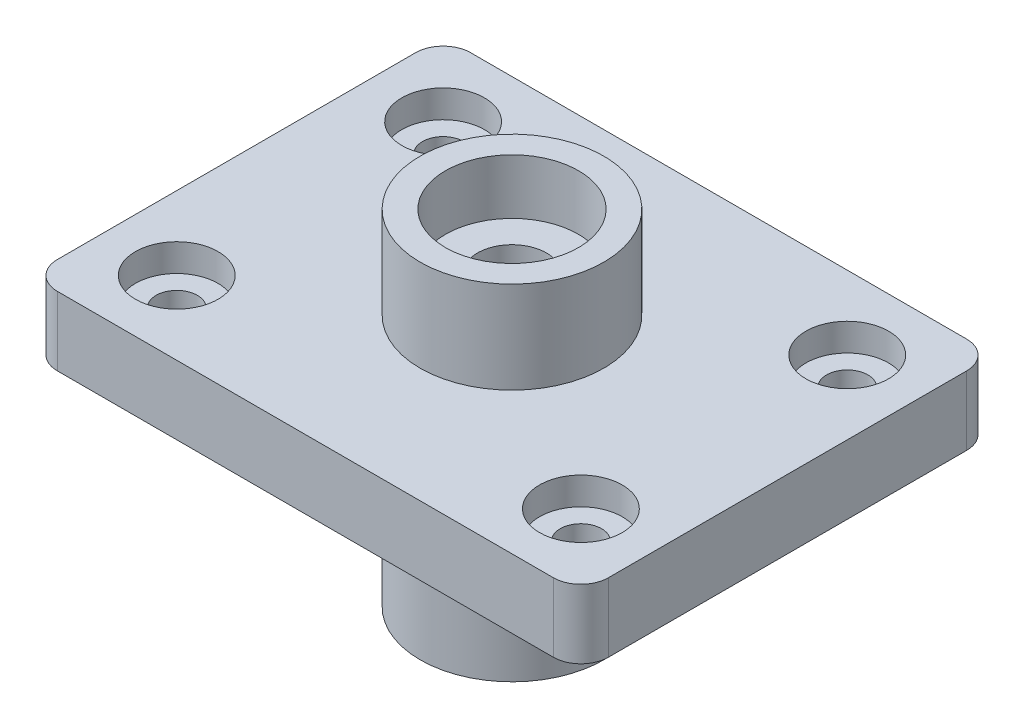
ISO-10303-21;
HEADER;
FILE_DESCRIPTION(('STEP AP214'),'2;1');
FILE_NAME('part.step','',(''),(''),'','','');
FILE_SCHEMA(('AUTOMOTIVE_DESIGN { 1 0 10303 214 1 1 1 1 }'));
ENDSEC;
DATA;
#1=APPLICATION_CONTEXT('core data for automotive mechanical design processes');
#2=APPLICATION_PROTOCOL_DEFINITION('international standard','automotive_design',2000,#1);
#3=PRODUCT_CONTEXT('',#1,'mechanical');
#4=PRODUCT('Part','Part','',(#3));
#5=PRODUCT_RELATED_PRODUCT_CATEGORY('part','',(#4));
#6=PRODUCT_DEFINITION_FORMATION('','',#4);
#7=PRODUCT_DEFINITION_CONTEXT('part definition',#1,'design');
#8=PRODUCT_DEFINITION('design','',#6,#7);
#9=PRODUCT_DEFINITION_SHAPE('','',#8);
#10=(LENGTH_UNIT() NAMED_UNIT(*) SI_UNIT(.MILLI.,.METRE.));
#11=(NAMED_UNIT(*) PLANE_ANGLE_UNIT() SI_UNIT($,.RADIAN.));
#12=(NAMED_UNIT(*) SI_UNIT($,.STERADIAN.) SOLID_ANGLE_UNIT());
#13=UNCERTAINTY_MEASURE_WITH_UNIT(LENGTH_MEASURE(1.E-05),#10,'distance_accuracy_value','');
#14=(GEOMETRIC_REPRESENTATION_CONTEXT(3) GLOBAL_UNCERTAINTY_ASSIGNED_CONTEXT((#13)) GLOBAL_UNIT_ASSIGNED_CONTEXT((#10,
#11,#12)) REPRESENTATION_CONTEXT('',''));
#15=CARTESIAN_POINT('',(0.,0.,0.));
#16=DIRECTION('',(0.,0.,1.));
#17=DIRECTION('',(1.,0.,0.));
#18=AXIS2_PLACEMENT_3D('',#15,#16,#17);
#19=CARTESIAN_POINT('',(0.,40.,0.));
#20=DIRECTION('',(0.,1.,0.));
#21=DIRECTION('',(0.,0.,1.));
#22=AXIS2_PLACEMENT_3D('',#19,#20,#21);
#23=CYLINDRICAL_SURFACE('',#22,15.);
#24=CARTESIAN_POINT('',(0.,-110.,0.));
#25=DIRECTION('',(0.,1.,0.));
#26=DIRECTION('',(0.,0.,1.));
#27=AXIS2_PLACEMENT_3D('',#24,#25,#26);
#28=CIRCLE('',#27,15.);
#29=CARTESIAN_POINT('',(0.,-110.,15.));
#30=VERTEX_POINT('',#29);
#31=EDGE_CURVE('E183',#30,#30,#28,.T.);
#32=ORIENTED_EDGE('',*,*,#31,.F.);
#33=EDGE_LOOP('',(#32));
#34=FACE_BOUND('',#33,.T.);
#35=CARTESIAN_POINT('',(0.,-98.,0.));
#36=DIRECTION('',(0.,1.,0.));
#37=DIRECTION('',(0.,0.,1.));
#38=AXIS2_PLACEMENT_3D('',#35,#36,#37);
#39=CIRCLE('',#38,15.);
#40=CARTESIAN_POINT('',(0.,-98.,15.));
#41=VERTEX_POINT('',#40);
#42=EDGE_CURVE('E177',#41,#41,#39,.F.);
#43=ORIENTED_EDGE('',*,*,#42,.F.);
#44=EDGE_LOOP('',(#43));
#45=FACE_BOUND('',#44,.T.);
#46=ADVANCED_FACE('F30',(#34,#45),#23,.F.);
#47=CARTESIAN_POINT('',(-120.,-30.,-90.));
#48=DIRECTION('',(-1.,0.,0.));
#49=DIRECTION('',(0.,0.,1.));
#50=AXIS2_PLACEMENT_3D('',#47,#48,#49);
#51=PLANE('',#50);
#52=DIRECTION('',(0.,0.,1.));
#53=VECTOR('',#52,1.);
#54=CARTESIAN_POINT('',(-120.,-30.,-90.));
#55=LINE('',#54,#53);
#56=CARTESIAN_POINT('',(-120.,-30.,-78.));
#57=VERTEX_POINT('',#56);
#58=CARTESIAN_POINT('',(-120.,-30.,77.9999999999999));
#59=VERTEX_POINT('',#58);
#60=EDGE_CURVE('E152',#57,#59,#55,.T.);
#61=ORIENTED_EDGE('',*,*,#60,.T.);
#62=DIRECTION('',(0.,1.,0.));
#63=VECTOR('',#62,1.);
#64=CARTESIAN_POINT('',(-120.,-30.,78.));
#65=LINE('',#64,#63);
#66=CARTESIAN_POINT('',(-120.,0.,77.9999999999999));
#67=VERTEX_POINT('',#66);
#68=EDGE_CURVE('E11',#59,#67,#65,.T.);
#69=ORIENTED_EDGE('',*,*,#68,.T.);
#70=DIRECTION('',(0.,0.,1.));
#71=VECTOR('',#70,1.);
#72=CARTESIAN_POINT('',(-120.,0.,-90.));
#73=LINE('',#72,#71);
#74=CARTESIAN_POINT('',(-120.,0.,-78.));
#75=VERTEX_POINT('',#74);
#76=EDGE_CURVE('E155',#75,#67,#73,.T.);
#77=ORIENTED_EDGE('',*,*,#76,.F.);
#78=DIRECTION('',(0.,1.,0.));
#79=VECTOR('',#78,1.);
#80=CARTESIAN_POINT('',(-120.,-30.,-78.));
#81=LINE('',#80,#79);
#82=EDGE_CURVE('E38',#75,#57,#81,.F.);
#83=ORIENTED_EDGE('',*,*,#82,.T.);
#84=EDGE_LOOP('',(#61,#69,#77,#83));
#85=FACE_BOUND('',#84,.T.);
#86=ADVANCED_FACE('F32',(#85),#51,.T.);
#87=CARTESIAN_POINT('',(-120.,-30.,-90.));
#88=DIRECTION('',(0.,0.,-1.));
#89=DIRECTION('',(-1.,0.,0.));
#90=AXIS2_PLACEMENT_3D('',#87,#88,#89);
#91=PLANE('',#90);
#92=DIRECTION('',(-1.,0.,0.));
#93=VECTOR('',#92,1.);
#94=CARTESIAN_POINT('',(-120.,0.,-90.));
#95=LINE('',#94,#93);
#96=CARTESIAN_POINT('',(108.,0.,-90.));
#97=VERTEX_POINT('',#96);
#98=CARTESIAN_POINT('',(-108.,0.,-90.));
#99=VERTEX_POINT('',#98);
#100=EDGE_CURVE('E116',#97,#99,#95,.T.);
#101=ORIENTED_EDGE('',*,*,#100,.F.);
#102=DIRECTION('',(0.,1.,0.));
#103=VECTOR('',#102,1.);
#104=CARTESIAN_POINT('',(108.,-30.,-90.));
#105=LINE('',#104,#103);
#106=CARTESIAN_POINT('',(108.,-30.,-90.));
#107=VERTEX_POINT('',#106);
#108=EDGE_CURVE('E136',#97,#107,#105,.F.);
#109=ORIENTED_EDGE('',*,*,#108,.T.);
#110=DIRECTION('',(-1.,0.,0.));
#111=VECTOR('',#110,1.);
#112=CARTESIAN_POINT('',(-120.,-30.,-90.));
#113=LINE('',#112,#111);
#114=CARTESIAN_POINT('',(-108.,-30.,-90.));
#115=VERTEX_POINT('',#114);
#116=EDGE_CURVE('E124',#107,#115,#113,.T.);
#117=ORIENTED_EDGE('',*,*,#116,.T.);
#118=DIRECTION('',(0.,1.,0.));
#119=VECTOR('',#118,1.);
#120=CARTESIAN_POINT('',(-108.,-30.,-90.));
#121=LINE('',#120,#119);
#122=EDGE_CURVE('E133',#115,#99,#121,.T.);
#123=ORIENTED_EDGE('',*,*,#122,.T.);
#124=EDGE_LOOP('',(#101,#109,#117,#123));
#125=FACE_BOUND('',#124,.T.);
#126=ADVANCED_FACE('F169',(#125),#91,.T.);
#127=CARTESIAN_POINT('',(120.,-30.,-90.));
#128=DIRECTION('',(1.,0.,0.));
#129=DIRECTION('',(0.,0.,-1.));
#130=AXIS2_PLACEMENT_3D('',#127,#128,#129);
#131=PLANE('',#130);
#132=DIRECTION('',(0.,0.,-1.));
#133=VECTOR('',#132,1.);
#134=CARTESIAN_POINT('',(120.,-30.,-90.));
#135=LINE('',#134,#133);
#136=CARTESIAN_POINT('',(120.,-30.,77.9999999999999));
#137=VERTEX_POINT('',#136);
#138=CARTESIAN_POINT('',(120.,-30.,-78.));
#139=VERTEX_POINT('',#138);
#140=EDGE_CURVE('E175',#137,#139,#135,.T.);
#141=ORIENTED_EDGE('',*,*,#140,.T.);
#142=DIRECTION('',(0.,1.,0.));
#143=VECTOR('',#142,1.);
#144=CARTESIAN_POINT('',(120.,-30.,-78.));
#145=LINE('',#144,#143);
#146=CARTESIAN_POINT('',(120.,0.,-78.));
#147=VERTEX_POINT('',#146);
#148=EDGE_CURVE('E115',#139,#147,#145,.T.);
#149=ORIENTED_EDGE('',*,*,#148,.T.);
#150=DIRECTION('',(0.,0.,-1.));
#151=VECTOR('',#150,1.);
#152=CARTESIAN_POINT('',(120.,0.,-90.));
#153=LINE('',#152,#151);
#154=CARTESIAN_POINT('',(120.,0.,77.9999999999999));
#155=VERTEX_POINT('',#154);
#156=EDGE_CURVE('E100',#155,#147,#153,.T.);
#157=ORIENTED_EDGE('',*,*,#156,.F.);
#158=DIRECTION('',(0.,1.,0.));
#159=VECTOR('',#158,1.);
#160=CARTESIAN_POINT('',(120.,-30.,78.));
#161=LINE('',#160,#159);
#162=EDGE_CURVE('E113',#155,#137,#161,.F.);
#163=ORIENTED_EDGE('',*,*,#162,.T.);
#164=EDGE_LOOP('',(#141,#149,#157,#163));
#165=FACE_BOUND('',#164,.T.);
#166=ADVANCED_FACE('F112',(#165),#131,.T.);
#167=CARTESIAN_POINT('',(-120.,-30.,90.));
#168=DIRECTION('',(0.,0.,1.));
#169=DIRECTION('',(1.,0.,0.));
#170=AXIS2_PLACEMENT_3D('',#167,#168,#169);
#171=PLANE('',#170);
#172=DIRECTION('',(1.,0.,0.));
#173=VECTOR('',#172,1.);
#174=CARTESIAN_POINT('',(-120.,-30.,90.));
#175=LINE('',#174,#173);
#176=CARTESIAN_POINT('',(-108.,-30.,90.));
#177=VERTEX_POINT('',#176);
#178=CARTESIAN_POINT('',(108.,-30.,90.));
#179=VERTEX_POINT('',#178);
#180=EDGE_CURVE('E162',#177,#179,#175,.T.);
#181=ORIENTED_EDGE('',*,*,#180,.T.);
#182=DIRECTION('',(0.,1.,0.));
#183=VECTOR('',#182,1.);
#184=CARTESIAN_POINT('',(108.,-30.,90.));
#185=LINE('',#184,#183);
#186=CARTESIAN_POINT('',(108.,0.,90.));
#187=VERTEX_POINT('',#186);
#188=EDGE_CURVE('E146',#179,#187,#185,.T.);
#189=ORIENTED_EDGE('',*,*,#188,.T.);
#190=DIRECTION('',(1.,0.,0.));
#191=VECTOR('',#190,1.);
#192=CARTESIAN_POINT('',(-120.,0.,90.));
#193=LINE('',#192,#191);
#194=CARTESIAN_POINT('',(-108.,0.,90.));
#195=VERTEX_POINT('',#194);
#196=EDGE_CURVE('E101',#195,#187,#193,.T.);
#197=ORIENTED_EDGE('',*,*,#196,.F.);
#198=DIRECTION('',(0.,1.,0.));
#199=VECTOR('',#198,1.);
#200=CARTESIAN_POINT('',(-108.,-30.,90.));
#201=LINE('',#200,#199);
#202=EDGE_CURVE('E52',#195,#177,#201,.F.);
#203=ORIENTED_EDGE('',*,*,#202,.T.);
#204=EDGE_LOOP('',(#181,#189,#197,#203));
#205=FACE_BOUND('',#204,.T.);
#206=ADVANCED_FACE('F215',(#205),#171,.T.);
#207=CARTESIAN_POINT('',(-120.,-30.,90.));
#208=DIRECTION('',(0.,1.,0.));
#209=DIRECTION('',(0.,0.,1.));
#210=AXIS2_PLACEMENT_3D('',#207,#208,#209);
#211=PLANE('',#210);
#212=CARTESIAN_POINT('',(88.,-30.,58.));
#213=DIRECTION('',(0.,1.,0.));
#214=DIRECTION('',(0.,0.,1.));
#215=AXIS2_PLACEMENT_3D('',#212,#213,#214);
#216=CIRCLE('',#215,9.);
#217=CARTESIAN_POINT('',(88.,-30.,67.));
#218=VERTEX_POINT('',#217);
#219=EDGE_CURVE('E545',#218,#218,#216,.T.);
#220=ORIENTED_EDGE('',*,*,#219,.T.);
#221=EDGE_LOOP('',(#220));
#222=FACE_BOUND('',#221,.T.);
#223=CARTESIAN_POINT('',(-88.,-30.,58.));
#224=DIRECTION('',(0.,1.,0.));
#225=DIRECTION('',(0.,0.,1.));
#226=AXIS2_PLACEMENT_3D('',#223,#224,#225);
#227=CIRCLE('',#226,9.);
#228=CARTESIAN_POINT('',(-88.,-30.,67.));
#229=VERTEX_POINT('',#228);
#230=EDGE_CURVE('E557',#229,#229,#227,.T.);
#231=ORIENTED_EDGE('',*,*,#230,.T.);
#232=EDGE_LOOP('',(#231));
#233=FACE_BOUND('',#232,.T.);
#234=CARTESIAN_POINT('',(88.,-30.,-58.));
#235=DIRECTION('',(0.,1.,0.));
#236=DIRECTION('',(0.,0.,1.));
#237=AXIS2_PLACEMENT_3D('',#234,#235,#236);
#238=CIRCLE('',#237,9.);
#239=CARTESIAN_POINT('',(88.,-30.,-49.));
#240=VERTEX_POINT('',#239);
#241=EDGE_CURVE('E569',#240,#240,#238,.T.);
#242=ORIENTED_EDGE('',*,*,#241,.T.);
#243=EDGE_LOOP('',(#242));
#244=FACE_BOUND('',#243,.T.);
#245=CARTESIAN_POINT('',(-88.,-30.,-58.));
#246=DIRECTION('',(0.,1.,0.));
#247=DIRECTION('',(0.,0.,1.));
#248=AXIS2_PLACEMENT_3D('',#245,#246,#247);
#249=CIRCLE('',#248,9.);
#250=CARTESIAN_POINT('',(-88.,-30.,-49.));
#251=VERTEX_POINT('',#250);
#252=EDGE_CURVE('E190',#251,#251,#249,.T.);
#253=ORIENTED_EDGE('',*,*,#252,.T.);
#254=EDGE_LOOP('',(#253));
#255=FACE_BOUND('',#254,.T.);
#256=CARTESIAN_POINT('',(0.,-30.,0.));
#257=DIRECTION('',(0.,1.,0.));
#258=DIRECTION('',(0.,0.,1.));
#259=AXIS2_PLACEMENT_3D('',#256,#257,#258);
#260=CIRCLE('',#259,40.);
#261=CARTESIAN_POINT('',(0.,-30.,40.));
#262=VERTEX_POINT('',#261);
#263=EDGE_CURVE('E211',#262,#262,#260,.T.);
#264=ORIENTED_EDGE('',*,*,#263,.T.);
#265=EDGE_LOOP('',(#264));
#266=FACE_BOUND('',#265,.T.);
#267=ORIENTED_EDGE('',*,*,#116,.F.);
#268=CARTESIAN_POINT('',(108.,-30.,-78.));
#269=DIRECTION('',(0.,1.,0.));
#270=DIRECTION('',(0.,0.,1.));
#271=AXIS2_PLACEMENT_3D('',#268,#269,#270);
#272=CIRCLE('',#271,12.);
#273=EDGE_CURVE('E143',#107,#139,#272,.F.);
#274=ORIENTED_EDGE('',*,*,#273,.T.);
#275=ORIENTED_EDGE('',*,*,#140,.F.);
#276=CARTESIAN_POINT('',(108.,-30.,78.));
#277=DIRECTION('',(0.,1.,0.));
#278=DIRECTION('',(0.,0.,1.));
#279=AXIS2_PLACEMENT_3D('',#276,#277,#278);
#280=CIRCLE('',#279,12.);
#281=EDGE_CURVE('E45',#137,#179,#280,.F.);
#282=ORIENTED_EDGE('',*,*,#281,.T.);
#283=ORIENTED_EDGE('',*,*,#180,.F.);
#284=CARTESIAN_POINT('',(-108.,-30.,78.));
#285=DIRECTION('',(0.,1.,0.));
#286=DIRECTION('',(0.,0.,1.));
#287=AXIS2_PLACEMENT_3D('',#284,#285,#286);
#288=CIRCLE('',#287,12.);
#289=EDGE_CURVE('E140',#177,#59,#288,.F.);
#290=ORIENTED_EDGE('',*,*,#289,.T.);
#291=ORIENTED_EDGE('',*,*,#60,.F.);
#292=CARTESIAN_POINT('',(-108.,-30.,-78.));
#293=DIRECTION('',(0.,1.,0.));
#294=DIRECTION('',(0.,0.,1.));
#295=AXIS2_PLACEMENT_3D('',#292,#293,#294);
#296=CIRCLE('',#295,12.);
#297=EDGE_CURVE('E138',#57,#115,#296,.F.);
#298=ORIENTED_EDGE('',*,*,#297,.T.);
#299=EDGE_LOOP('',(#267,#274,#275,#282,#283,#290,#291,#298));
#300=FACE_BOUND('',#299,.T.);
#301=ADVANCED_FACE('F159',(#222,#233,#244,#255,#266,#300),#211,.F.);
#302=CARTESIAN_POINT('',(-120.,0.,90.));
#303=DIRECTION('',(0.,1.,0.));
#304=DIRECTION('',(0.,0.,1.));
#305=AXIS2_PLACEMENT_3D('',#302,#303,#304);
#306=PLANE('',#305);
#307=CARTESIAN_POINT('',(88.,0.,58.));
#308=DIRECTION('',(0.,1.,0.));
#309=DIRECTION('',(0.,0.,1.));
#310=AXIS2_PLACEMENT_3D('',#307,#308,#309);
#311=CIRCLE('',#310,18.);
#312=CARTESIAN_POINT('',(88.,0.,76.));
#313=VERTEX_POINT('',#312);
#314=EDGE_CURVE('E538',#313,#313,#311,.T.);
#315=ORIENTED_EDGE('',*,*,#314,.F.);
#316=EDGE_LOOP('',(#315));
#317=FACE_BOUND('',#316,.T.);
#318=CARTESIAN_POINT('',(-88.,0.,58.));
#319=DIRECTION('',(0.,1.,0.));
#320=DIRECTION('',(0.,0.,1.));
#321=AXIS2_PLACEMENT_3D('',#318,#319,#320);
#322=CIRCLE('',#321,18.);
#323=CARTESIAN_POINT('',(-88.,0.,76.));
#324=VERTEX_POINT('',#323);
#325=EDGE_CURVE('E548',#324,#324,#322,.T.);
#326=ORIENTED_EDGE('',*,*,#325,.F.);
#327=EDGE_LOOP('',(#326));
#328=FACE_BOUND('',#327,.T.);
#329=CARTESIAN_POINT('',(88.,0.,-58.));
#330=DIRECTION('',(0.,1.,0.));
#331=DIRECTION('',(0.,0.,1.));
#332=AXIS2_PLACEMENT_3D('',#329,#330,#331);
#333=CIRCLE('',#332,18.);
#334=CARTESIAN_POINT('',(88.,0.,-40.));
#335=VERTEX_POINT('',#334);
#336=EDGE_CURVE('E560',#335,#335,#333,.T.);
#337=ORIENTED_EDGE('',*,*,#336,.F.);
#338=EDGE_LOOP('',(#337));
#339=FACE_BOUND('',#338,.T.);
#340=CARTESIAN_POINT('',(-88.,0.,-58.));
#341=DIRECTION('',(0.,1.,0.));
#342=DIRECTION('',(0.,0.,1.));
#343=AXIS2_PLACEMENT_3D('',#340,#341,#342);
#344=CIRCLE('',#343,18.);
#345=CARTESIAN_POINT('',(-88.,0.,-40.));
#346=VERTEX_POINT('',#345);
#347=EDGE_CURVE('E572',#346,#346,#344,.T.);
#348=ORIENTED_EDGE('',*,*,#347,.F.);
#349=EDGE_LOOP('',(#348));
#350=FACE_BOUND('',#349,.T.);
#351=CARTESIAN_POINT('',(0.,0.,0.));
#352=DIRECTION('',(0.,1.,0.));
#353=DIRECTION('',(0.,0.,1.));
#354=AXIS2_PLACEMENT_3D('',#351,#352,#353);
#355=CIRCLE('',#354,40.);
#356=CARTESIAN_POINT('',(0.,0.,40.));
#357=VERTEX_POINT('',#356);
#358=EDGE_CURVE('E119',#357,#357,#355,.T.);
#359=ORIENTED_EDGE('',*,*,#358,.F.);
#360=EDGE_LOOP('',(#359));
#361=FACE_BOUND('',#360,.T.);
#362=ORIENTED_EDGE('',*,*,#156,.T.);
#363=CARTESIAN_POINT('',(108.,0.,-78.));
#364=DIRECTION('',(0.,1.,0.));
#365=DIRECTION('',(0.,0.,1.));
#366=AXIS2_PLACEMENT_3D('',#363,#364,#365);
#367=CIRCLE('',#366,12.);
#368=EDGE_CURVE('E106',#147,#97,#367,.T.);
#369=ORIENTED_EDGE('',*,*,#368,.T.);
#370=ORIENTED_EDGE('',*,*,#100,.T.);
#371=CARTESIAN_POINT('',(-108.,0.,-78.));
#372=DIRECTION('',(0.,1.,0.));
#373=DIRECTION('',(0.,0.,1.));
#374=AXIS2_PLACEMENT_3D('',#371,#372,#373);
#375=CIRCLE('',#374,12.);
#376=EDGE_CURVE('E121',#99,#75,#375,.T.);
#377=ORIENTED_EDGE('',*,*,#376,.T.);
#378=ORIENTED_EDGE('',*,*,#76,.T.);
#379=CARTESIAN_POINT('',(-108.,0.,78.));
#380=DIRECTION('',(0.,1.,0.));
#381=DIRECTION('',(0.,0.,1.));
#382=AXIS2_PLACEMENT_3D('',#379,#380,#381);
#383=CIRCLE('',#382,12.);
#384=EDGE_CURVE('E107',#67,#195,#383,.T.);
#385=ORIENTED_EDGE('',*,*,#384,.T.);
#386=ORIENTED_EDGE('',*,*,#196,.T.);
#387=CARTESIAN_POINT('',(108.,0.,78.));
#388=DIRECTION('',(0.,1.,0.));
#389=DIRECTION('',(0.,0.,1.));
#390=AXIS2_PLACEMENT_3D('',#387,#388,#389);
#391=CIRCLE('',#390,12.);
#392=EDGE_CURVE('E97',#187,#155,#391,.T.);
#393=ORIENTED_EDGE('',*,*,#392,.T.);
#394=EDGE_LOOP('',(#362,#369,#370,#377,#378,#385,#386,#393));
#395=FACE_BOUND('',#394,.T.);
#396=ADVANCED_FACE('F99',(#317,#328,#339,#350,#361,#395),#306,.T.);
#397=CARTESIAN_POINT('',(0.,40.,0.));
#398=DIRECTION('',(0.,1.,0.));
#399=DIRECTION('',(0.,0.,1.));
#400=AXIS2_PLACEMENT_3D('',#397,#398,#399);
#401=PLANE('',#400);
#402=CARTESIAN_POINT('',(0.,40.,0.));
#403=DIRECTION('',(0.,1.,0.));
#404=DIRECTION('',(0.,0.,1.));
#405=AXIS2_PLACEMENT_3D('',#402,#403,#404);
#406=CIRCLE('',#405,29.);
#407=CARTESIAN_POINT('',(0.,40.,29.));
#408=VERTEX_POINT('',#407);
#409=EDGE_CURVE('E202',#408,#408,#406,.T.);
#410=ORIENTED_EDGE('',*,*,#409,.F.);
#411=EDGE_LOOP('',(#410));
#412=FACE_BOUND('',#411,.T.);
#413=CARTESIAN_POINT('',(0.,40.,0.));
#414=DIRECTION('',(0.,1.,0.));
#415=DIRECTION('',(0.,0.,1.));
#416=AXIS2_PLACEMENT_3D('',#413,#414,#415);
#417=CIRCLE('',#416,40.);
#418=CARTESIAN_POINT('',(0.,40.,40.));
#419=VERTEX_POINT('',#418);
#420=EDGE_CURVE('E205',#419,#419,#417,.T.);
#421=ORIENTED_EDGE('',*,*,#420,.T.);
#422=EDGE_LOOP('',(#421));
#423=FACE_BOUND('',#422,.T.);
#424=ADVANCED_FACE('F262',(#412,#423),#401,.T.);
#425=CARTESIAN_POINT('',(0.,-110.,0.));
#426=DIRECTION('',(0.,1.,0.));
#427=DIRECTION('',(0.,0.,1.));
#428=AXIS2_PLACEMENT_3D('',#425,#426,#427);
#429=CYLINDRICAL_SURFACE('',#428,40.);
#430=ORIENTED_EDGE('',*,*,#358,.T.);
#431=EDGE_LOOP('',(#430));
#432=FACE_BOUND('',#431,.T.);
#433=ORIENTED_EDGE('',*,*,#420,.F.);
#434=EDGE_LOOP('',(#433));
#435=FACE_BOUND('',#434,.T.);
#436=ADVANCED_FACE('F265',(#432,#435),#429,.T.);
#437=CARTESIAN_POINT('',(0.,-110.,0.));
#438=DIRECTION('',(0.,1.,0.));
#439=DIRECTION('',(0.,0.,1.));
#440=AXIS2_PLACEMENT_3D('',#437,#438,#439);
#441=CIRCLE('',#440,40.);
#442=CARTESIAN_POINT('',(0.,-110.,40.));
#443=VERTEX_POINT('',#442);
#444=EDGE_CURVE('E208',#443,#443,#441,.T.);
#445=ORIENTED_EDGE('',*,*,#444,.T.);
#446=EDGE_LOOP('',(#445));
#447=FACE_BOUND('',#446,.T.);
#448=ORIENTED_EDGE('',*,*,#263,.F.);
#449=EDGE_LOOP('',(#448));
#450=FACE_BOUND('',#449,.T.);
#451=ADVANCED_FACE('F270',(#447,#450),#429,.T.);
#452=CARTESIAN_POINT('',(0.,-110.,0.));
#453=DIRECTION('',(0.,1.,0.));
#454=DIRECTION('',(0.,0.,1.));
#455=AXIS2_PLACEMENT_3D('',#452,#453,#454);
#456=PLANE('',#455);
#457=ORIENTED_EDGE('',*,*,#31,.T.);
#458=EDGE_LOOP('',(#457));
#459=FACE_BOUND('',#458,.T.);
#460=ORIENTED_EDGE('',*,*,#444,.F.);
#461=EDGE_LOOP('',(#460));
#462=FACE_BOUND('',#461,.T.);
#463=ADVANCED_FACE('F258',(#459,#462),#456,.F.);
#464=CARTESIAN_POINT('',(0.,40.,0.));
#465=DIRECTION('',(0.,1.,0.));
#466=DIRECTION('',(0.,0.,1.));
#467=AXIS2_PLACEMENT_3D('',#464,#465,#466);
#468=CYLINDRICAL_SURFACE('',#467,29.);
#469=CARTESIAN_POINT('',(0.,16.,0.));
#470=DIRECTION('',(0.,1.,0.));
#471=DIRECTION('',(0.,0.,1.));
#472=AXIS2_PLACEMENT_3D('',#469,#470,#471);
#473=CIRCLE('',#472,29.);
#474=CARTESIAN_POINT('',(0.,16.,29.));
#475=VERTEX_POINT('',#474);
#476=EDGE_CURVE('E199',#475,#475,#473,.T.);
#477=ORIENTED_EDGE('',*,*,#476,.F.);
#478=EDGE_LOOP('',(#477));
#479=FACE_BOUND('',#478,.T.);
#480=ORIENTED_EDGE('',*,*,#409,.T.);
#481=EDGE_LOOP('',(#480));
#482=FACE_BOUND('',#481,.T.);
#483=ADVANCED_FACE('F248',(#479,#482),#468,.F.);
#484=CARTESIAN_POINT('',(15.,16.,0.));
#485=DIRECTION('',(0.,-1.,0.));
#486=DIRECTION('',(0.,0.,-1.));
#487=AXIS2_PLACEMENT_3D('',#484,#485,#486);
#488=PLANE('',#487);
#489=CARTESIAN_POINT('',(0.,16.,0.));
#490=DIRECTION('',(0.,1.,0.));
#491=DIRECTION('',(0.,0.,1.));
#492=AXIS2_PLACEMENT_3D('',#489,#490,#491);
#493=CIRCLE('',#492,15.);
#494=CARTESIAN_POINT('',(0.,16.,15.));
#495=VERTEX_POINT('',#494);
#496=EDGE_CURVE('E196',#495,#495,#493,.T.);
#497=ORIENTED_EDGE('',*,*,#496,.F.);
#498=EDGE_LOOP('',(#497));
#499=FACE_BOUND('',#498,.T.);
#500=ORIENTED_EDGE('',*,*,#476,.T.);
#501=EDGE_LOOP('',(#500));
#502=FACE_BOUND('',#501,.T.);
#503=ADVANCED_FACE('F239',(#499,#502),#488,.F.);
#504=CARTESIAN_POINT('',(0.,-86.,0.));
#505=DIRECTION('',(0.,1.,0.));
#506=DIRECTION('',(0.,0.,1.));
#507=AXIS2_PLACEMENT_3D('',#504,#505,#506);
#508=CIRCLE('',#507,15.);
#509=CARTESIAN_POINT('',(0.,-86.,15.));
#510=VERTEX_POINT('',#509);
#511=EDGE_CURVE('E127',#510,#510,#508,.F.);
#512=ORIENTED_EDGE('',*,*,#511,.T.);
#513=EDGE_LOOP('',(#512));
#514=FACE_BOUND('',#513,.T.);
#515=ORIENTED_EDGE('',*,*,#496,.T.);
#516=EDGE_LOOP('',(#515));
#517=FACE_BOUND('',#516,.T.);
#518=ADVANCED_FACE('F229',(#514,#517),#23,.F.);
#519=CARTESIAN_POINT('',(0.,-86.,0.));
#520=DIRECTION('',(0.,1.,0.));
#521=DIRECTION('',(0.,0.,1.));
#522=AXIS2_PLACEMENT_3D('',#519,#520,#521);
#523=PLANE('',#522);
#524=CARTESIAN_POINT('',(0.,-86.,0.));
#525=DIRECTION('',(0.,1.,0.));
#526=DIRECTION('',(0.,0.,1.));
#527=AXIS2_PLACEMENT_3D('',#524,#525,#526);
#528=CIRCLE('',#527,23.);
#529=CARTESIAN_POINT('',(0.,-86.,23.));
#530=VERTEX_POINT('',#529);
#531=EDGE_CURVE('E179',#530,#530,#528,.T.);
#532=ORIENTED_EDGE('',*,*,#531,.F.);
#533=EDGE_LOOP('',(#532));
#534=FACE_BOUND('',#533,.T.);
#535=ORIENTED_EDGE('',*,*,#511,.F.);
#536=EDGE_LOOP('',(#535));
#537=FACE_BOUND('',#536,.T.);
#538=ADVANCED_FACE('F238',(#534,#537),#523,.F.);
#539=CARTESIAN_POINT('',(0.,-98.,0.));
#540=DIRECTION('',(0.,1.,0.));
#541=DIRECTION('',(0.,0.,1.));
#542=AXIS2_PLACEMENT_3D('',#539,#540,#541);
#543=PLANE('',#542);
#544=CARTESIAN_POINT('',(0.,-98.,0.));
#545=DIRECTION('',(0.,1.,0.));
#546=DIRECTION('',(0.,0.,1.));
#547=AXIS2_PLACEMENT_3D('',#544,#545,#546);
#548=CIRCLE('',#547,23.);
#549=CARTESIAN_POINT('',(0.,-98.,23.));
#550=VERTEX_POINT('',#549);
#551=EDGE_CURVE('E185',#550,#550,#548,.T.);
#552=ORIENTED_EDGE('',*,*,#551,.T.);
#553=EDGE_LOOP('',(#552));
#554=FACE_BOUND('',#553,.T.);
#555=ORIENTED_EDGE('',*,*,#42,.T.);
#556=EDGE_LOOP('',(#555));
#557=FACE_BOUND('',#556,.T.);
#558=ADVANCED_FACE('F245',(#554,#557),#543,.T.);
#559=CARTESIAN_POINT('',(0.,-86.,0.));
#560=DIRECTION('',(0.,-1.,0.));
#561=DIRECTION('',(0.,0.,-1.));
#562=AXIS2_PLACEMENT_3D('',#559,#560,#561);
#563=CYLINDRICAL_SURFACE('',#562,23.);
#564=ORIENTED_EDGE('',*,*,#531,.T.);
#565=EDGE_LOOP('',(#564));
#566=FACE_BOUND('',#565,.T.);
#567=ORIENTED_EDGE('',*,*,#551,.F.);
#568=EDGE_LOOP('',(#567));
#569=FACE_BOUND('',#568,.T.);
#570=ADVANCED_FACE('F353',(#566,#569),#563,.F.);
#571=CARTESIAN_POINT('',(-88.,0.,-58.));
#572=DIRECTION('',(0.,1.,0.));
#573=DIRECTION('',(0.,0.,1.));
#574=AXIS2_PLACEMENT_3D('',#571,#572,#573);
#575=CYLINDRICAL_SURFACE('',#574,9.);
#576=ORIENTED_EDGE('',*,*,#252,.F.);
#577=EDGE_LOOP('',(#576));
#578=FACE_BOUND('',#577,.T.);
#579=CARTESIAN_POINT('',(-88.,-12.,-58.));
#580=DIRECTION('',(0.,1.,0.));
#581=DIRECTION('',(0.,0.,1.));
#582=AXIS2_PLACEMENT_3D('',#579,#580,#581);
#583=CIRCLE('',#582,9.00000000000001);
#584=CARTESIAN_POINT('',(-88.,-12.,-49.));
#585=VERTEX_POINT('',#584);
#586=EDGE_CURVE('E578',#585,#585,#583,.T.);
#587=ORIENTED_EDGE('',*,*,#586,.T.);
#588=EDGE_LOOP('',(#587));
#589=FACE_BOUND('',#588,.T.);
#590=ADVANCED_FACE('F363',(#578,#589),#575,.F.);
#591=CARTESIAN_POINT('',(-79.,-12.,-58.));
#592=DIRECTION('',(0.,-1.,0.));
#593=DIRECTION('',(0.,0.,-1.));
#594=AXIS2_PLACEMENT_3D('',#591,#592,#593);
#595=PLANE('',#594);
#596=ORIENTED_EDGE('',*,*,#586,.F.);
#597=EDGE_LOOP('',(#596));
#598=FACE_BOUND('',#597,.T.);
#599=CARTESIAN_POINT('',(-88.,-12.,-58.));
#600=DIRECTION('',(0.,1.,0.));
#601=DIRECTION('',(0.,0.,1.));
#602=AXIS2_PLACEMENT_3D('',#599,#600,#601);
#603=CIRCLE('',#602,18.);
#604=CARTESIAN_POINT('',(-88.,-12.,-40.));
#605=VERTEX_POINT('',#604);
#606=EDGE_CURVE('E575',#605,#605,#603,.T.);
#607=ORIENTED_EDGE('',*,*,#606,.T.);
#608=EDGE_LOOP('',(#607));
#609=FACE_BOUND('',#608,.T.);
#610=ADVANCED_FACE('F371',(#598,#609),#595,.F.);
#611=CARTESIAN_POINT('',(-88.,0.,-58.));
#612=DIRECTION('',(0.,1.,0.));
#613=DIRECTION('',(0.,0.,1.));
#614=AXIS2_PLACEMENT_3D('',#611,#612,#613);
#615=CYLINDRICAL_SURFACE('',#614,18.);
#616=ORIENTED_EDGE('',*,*,#606,.F.);
#617=EDGE_LOOP('',(#616));
#618=FACE_BOUND('',#617,.T.);
#619=ORIENTED_EDGE('',*,*,#347,.T.);
#620=EDGE_LOOP('',(#619));
#621=FACE_BOUND('',#620,.T.);
#622=ADVANCED_FACE('F381',(#618,#621),#615,.F.);
#623=CARTESIAN_POINT('',(88.,0.,-58.));
#624=DIRECTION('',(0.,1.,0.));
#625=DIRECTION('',(0.,0.,1.));
#626=AXIS2_PLACEMENT_3D('',#623,#624,#625);
#627=CYLINDRICAL_SURFACE('',#626,9.);
#628=ORIENTED_EDGE('',*,*,#241,.F.);
#629=EDGE_LOOP('',(#628));
#630=FACE_BOUND('',#629,.T.);
#631=CARTESIAN_POINT('',(88.,-12.,-58.));
#632=DIRECTION('',(0.,1.,0.));
#633=DIRECTION('',(0.,0.,1.));
#634=AXIS2_PLACEMENT_3D('',#631,#632,#633);
#635=CIRCLE('',#634,9.00000000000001);
#636=CARTESIAN_POINT('',(88.,-12.,-49.));
#637=VERTEX_POINT('',#636);
#638=EDGE_CURVE('E566',#637,#637,#635,.T.);
#639=ORIENTED_EDGE('',*,*,#638,.T.);
#640=EDGE_LOOP('',(#639));
#641=FACE_BOUND('',#640,.T.);
#642=ADVANCED_FACE('F391',(#630,#641),#627,.F.);
#643=CARTESIAN_POINT('',(97.,-12.,-58.));
#644=DIRECTION('',(0.,-1.,0.));
#645=DIRECTION('',(0.,0.,-1.));
#646=AXIS2_PLACEMENT_3D('',#643,#644,#645);
#647=PLANE('',#646);
#648=ORIENTED_EDGE('',*,*,#638,.F.);
#649=EDGE_LOOP('',(#648));
#650=FACE_BOUND('',#649,.T.);
#651=CARTESIAN_POINT('',(88.,-12.,-58.));
#652=DIRECTION('',(0.,1.,0.));
#653=DIRECTION('',(0.,0.,1.));
#654=AXIS2_PLACEMENT_3D('',#651,#652,#653);
#655=CIRCLE('',#654,18.);
#656=CARTESIAN_POINT('',(88.,-12.,-40.));
#657=VERTEX_POINT('',#656);
#658=EDGE_CURVE('E563',#657,#657,#655,.T.);
#659=ORIENTED_EDGE('',*,*,#658,.T.);
#660=EDGE_LOOP('',(#659));
#661=FACE_BOUND('',#660,.T.);
#662=ADVANCED_FACE('F401',(#650,#661),#647,.F.);
#663=CARTESIAN_POINT('',(88.,0.,-58.));
#664=DIRECTION('',(0.,1.,0.));
#665=DIRECTION('',(0.,0.,1.));
#666=AXIS2_PLACEMENT_3D('',#663,#664,#665);
#667=CYLINDRICAL_SURFACE('',#666,18.);
#668=ORIENTED_EDGE('',*,*,#658,.F.);
#669=EDGE_LOOP('',(#668));
#670=FACE_BOUND('',#669,.T.);
#671=ORIENTED_EDGE('',*,*,#336,.T.);
#672=EDGE_LOOP('',(#671));
#673=FACE_BOUND('',#672,.T.);
#674=ADVANCED_FACE('F411',(#670,#673),#667,.F.);
#675=CARTESIAN_POINT('',(-88.,0.,58.));
#676=DIRECTION('',(0.,1.,0.));
#677=DIRECTION('',(0.,0.,1.));
#678=AXIS2_PLACEMENT_3D('',#675,#676,#677);
#679=CYLINDRICAL_SURFACE('',#678,9.);
#680=ORIENTED_EDGE('',*,*,#230,.F.);
#681=EDGE_LOOP('',(#680));
#682=FACE_BOUND('',#681,.T.);
#683=CARTESIAN_POINT('',(-88.,-12.,58.));
#684=DIRECTION('',(0.,1.,0.));
#685=DIRECTION('',(0.,0.,1.));
#686=AXIS2_PLACEMENT_3D('',#683,#684,#685);
#687=CIRCLE('',#686,9.00000000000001);
#688=CARTESIAN_POINT('',(-88.,-12.,67.));
#689=VERTEX_POINT('',#688);
#690=EDGE_CURVE('E554',#689,#689,#687,.T.);
#691=ORIENTED_EDGE('',*,*,#690,.T.);
#692=EDGE_LOOP('',(#691));
#693=FACE_BOUND('',#692,.T.);
#694=ADVANCED_FACE('F421',(#682,#693),#679,.F.);
#695=CARTESIAN_POINT('',(-79.,-12.,58.));
#696=DIRECTION('',(0.,-1.,0.));
#697=DIRECTION('',(0.,0.,-1.));
#698=AXIS2_PLACEMENT_3D('',#695,#696,#697);
#699=PLANE('',#698);
#700=ORIENTED_EDGE('',*,*,#690,.F.);
#701=EDGE_LOOP('',(#700));
#702=FACE_BOUND('',#701,.T.);
#703=CARTESIAN_POINT('',(-88.,-12.,58.));
#704=DIRECTION('',(0.,1.,0.));
#705=DIRECTION('',(0.,0.,1.));
#706=AXIS2_PLACEMENT_3D('',#703,#704,#705);
#707=CIRCLE('',#706,18.);
#708=CARTESIAN_POINT('',(-88.,-12.,76.));
#709=VERTEX_POINT('',#708);
#710=EDGE_CURVE('E551',#709,#709,#707,.T.);
#711=ORIENTED_EDGE('',*,*,#710,.T.);
#712=EDGE_LOOP('',(#711));
#713=FACE_BOUND('',#712,.T.);
#714=ADVANCED_FACE('F431',(#702,#713),#699,.F.);
#715=CARTESIAN_POINT('',(-88.,0.,58.));
#716=DIRECTION('',(0.,1.,0.));
#717=DIRECTION('',(0.,0.,1.));
#718=AXIS2_PLACEMENT_3D('',#715,#716,#717);
#719=CYLINDRICAL_SURFACE('',#718,18.);
#720=ORIENTED_EDGE('',*,*,#710,.F.);
#721=EDGE_LOOP('',(#720));
#722=FACE_BOUND('',#721,.T.);
#723=ORIENTED_EDGE('',*,*,#325,.T.);
#724=EDGE_LOOP('',(#723));
#725=FACE_BOUND('',#724,.T.);
#726=ADVANCED_FACE('F441',(#722,#725),#719,.F.);
#727=CARTESIAN_POINT('',(88.,0.,58.));
#728=DIRECTION('',(0.,1.,0.));
#729=DIRECTION('',(0.,0.,1.));
#730=AXIS2_PLACEMENT_3D('',#727,#728,#729);
#731=CYLINDRICAL_SURFACE('',#730,9.);
#732=ORIENTED_EDGE('',*,*,#219,.F.);
#733=EDGE_LOOP('',(#732));
#734=FACE_BOUND('',#733,.T.);
#735=CARTESIAN_POINT('',(88.,-12.,58.));
#736=DIRECTION('',(0.,1.,0.));
#737=DIRECTION('',(0.,0.,1.));
#738=AXIS2_PLACEMENT_3D('',#735,#736,#737);
#739=CIRCLE('',#738,9.00000000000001);
#740=CARTESIAN_POINT('',(88.,-12.,67.));
#741=VERTEX_POINT('',#740);
#742=EDGE_CURVE('E540',#741,#741,#739,.T.);
#743=ORIENTED_EDGE('',*,*,#742,.T.);
#744=EDGE_LOOP('',(#743));
#745=FACE_BOUND('',#744,.T.);
#746=ADVANCED_FACE('F451',(#734,#745),#731,.F.);
#747=CARTESIAN_POINT('',(97.,-12.,58.));
#748=DIRECTION('',(0.,-1.,0.));
#749=DIRECTION('',(0.,0.,-1.));
#750=AXIS2_PLACEMENT_3D('',#747,#748,#749);
#751=PLANE('',#750);
#752=ORIENTED_EDGE('',*,*,#742,.F.);
#753=EDGE_LOOP('',(#752));
#754=FACE_BOUND('',#753,.T.);
#755=CARTESIAN_POINT('',(88.,-12.,58.));
#756=DIRECTION('',(0.,1.,0.));
#757=DIRECTION('',(0.,0.,1.));
#758=AXIS2_PLACEMENT_3D('',#755,#756,#757);
#759=CIRCLE('',#758,18.);
#760=CARTESIAN_POINT('',(88.,-12.,76.));
#761=VERTEX_POINT('',#760);
#762=EDGE_CURVE('E535',#761,#761,#759,.T.);
#763=ORIENTED_EDGE('',*,*,#762,.T.);
#764=EDGE_LOOP('',(#763));
#765=FACE_BOUND('',#764,.T.);
#766=ADVANCED_FACE('F461',(#754,#765),#751,.F.);
#767=CARTESIAN_POINT('',(88.,0.,58.));
#768=DIRECTION('',(0.,1.,0.));
#769=DIRECTION('',(0.,0.,1.));
#770=AXIS2_PLACEMENT_3D('',#767,#768,#769);
#771=CYLINDRICAL_SURFACE('',#770,18.);
#772=ORIENTED_EDGE('',*,*,#762,.F.);
#773=EDGE_LOOP('',(#772));
#774=FACE_BOUND('',#773,.T.);
#775=ORIENTED_EDGE('',*,*,#314,.T.);
#776=EDGE_LOOP('',(#775));
#777=FACE_BOUND('',#776,.T.);
#778=ADVANCED_FACE('F471',(#774,#777),#771,.F.);
#779=CARTESIAN_POINT('',(108.,-30.,-78.));
#780=DIRECTION('',(0.,1.,0.));
#781=DIRECTION('',(0.,0.,1.));
#782=AXIS2_PLACEMENT_3D('',#779,#780,#781);
#783=CYLINDRICAL_SURFACE('',#782,12.);
#784=ORIENTED_EDGE('',*,*,#273,.F.);
#785=ORIENTED_EDGE('',*,*,#108,.F.);
#786=ORIENTED_EDGE('',*,*,#368,.F.);
#787=ORIENTED_EDGE('',*,*,#148,.F.);
#788=EDGE_LOOP('',(#784,#785,#786,#787));
#789=FACE_BOUND('',#788,.T.);
#790=ADVANCED_FACE('F224',(#789),#783,.T.);
#791=CARTESIAN_POINT('',(108.,-30.,78.));
#792=DIRECTION('',(0.,1.,0.));
#793=DIRECTION('',(0.,0.,1.));
#794=AXIS2_PLACEMENT_3D('',#791,#792,#793);
#795=CYLINDRICAL_SURFACE('',#794,12.);
#796=ORIENTED_EDGE('',*,*,#281,.F.);
#797=ORIENTED_EDGE('',*,*,#162,.F.);
#798=ORIENTED_EDGE('',*,*,#392,.F.);
#799=ORIENTED_EDGE('',*,*,#188,.F.);
#800=EDGE_LOOP('',(#796,#797,#798,#799));
#801=FACE_BOUND('',#800,.T.);
#802=ADVANCED_FACE('F118',(#801),#795,.T.);
#803=CARTESIAN_POINT('',(-108.,-30.,78.));
#804=DIRECTION('',(0.,1.,0.));
#805=DIRECTION('',(0.,0.,1.));
#806=AXIS2_PLACEMENT_3D('',#803,#804,#805);
#807=CYLINDRICAL_SURFACE('',#806,12.);
#808=ORIENTED_EDGE('',*,*,#289,.F.);
#809=ORIENTED_EDGE('',*,*,#202,.F.);
#810=ORIENTED_EDGE('',*,*,#384,.F.);
#811=ORIENTED_EDGE('',*,*,#68,.F.);
#812=EDGE_LOOP('',(#808,#809,#810,#811));
#813=FACE_BOUND('',#812,.T.);
#814=ADVANCED_FACE('F216',(#813),#807,.T.);
#815=CARTESIAN_POINT('',(-108.,-30.,-78.));
#816=DIRECTION('',(0.,1.,0.));
#817=DIRECTION('',(0.,0.,1.));
#818=AXIS2_PLACEMENT_3D('',#815,#816,#817);
#819=CYLINDRICAL_SURFACE('',#818,12.);
#820=ORIENTED_EDGE('',*,*,#297,.F.);
#821=ORIENTED_EDGE('',*,*,#82,.F.);
#822=ORIENTED_EDGE('',*,*,#376,.F.);
#823=ORIENTED_EDGE('',*,*,#122,.F.);
#824=EDGE_LOOP('',(#820,#821,#822,#823));
#825=FACE_BOUND('',#824,.T.);
#826=ADVANCED_FACE('F165',(#825),#819,.T.);
#827=CLOSED_SHELL('',(#46,#86,#126,#166,#206,#301,#396,#424,#436,#451,#463,#483,#503,#518,#538,
#558,#570,#590,#610,#622,#642,#662,#674,#694,#714,#726,#746,#766,#778,#790,#802,#814,#826));
#828=MANIFOLD_SOLID_BREP('B2',#827);
#829=ADVANCED_BREP_SHAPE_REPRESENTATION('',(#18,#828),#14);
#830=SHAPE_DEFINITION_REPRESENTATION(#9,#829);
ENDSEC;
END-ISO-10303-21;
